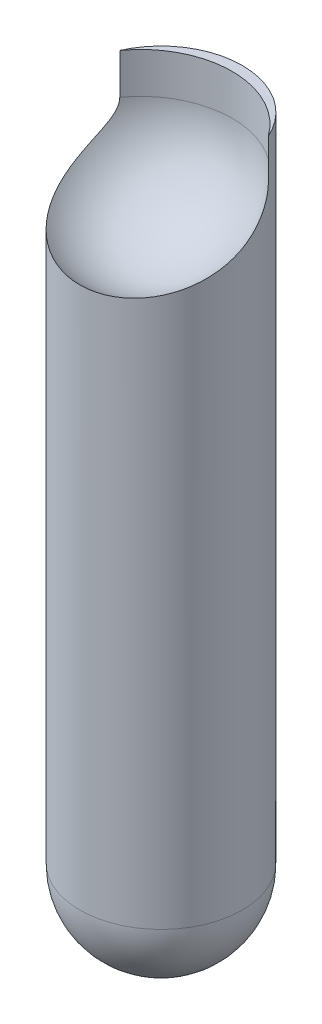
ISO-10303-21;
HEADER;
FILE_DESCRIPTION(('STEP AP214'),'2;1');
FILE_NAME('part.step','',(''),(''),'','','');
FILE_SCHEMA(('AUTOMOTIVE_DESIGN { 1 0 10303 214 1 1 1 1 }'));
ENDSEC;
DATA;
#1=APPLICATION_CONTEXT('core data for automotive mechanical design processes');
#2=APPLICATION_PROTOCOL_DEFINITION('international standard','automotive_design',2000,#1);
#3=PRODUCT_CONTEXT('',#1,'mechanical');
#4=PRODUCT('Part','Part','',(#3));
#5=PRODUCT_RELATED_PRODUCT_CATEGORY('part','',(#4));
#6=PRODUCT_DEFINITION_FORMATION('','',#4);
#7=PRODUCT_DEFINITION_CONTEXT('part definition',#1,'design');
#8=PRODUCT_DEFINITION('design','',#6,#7);
#9=PRODUCT_DEFINITION_SHAPE('','',#8);
#10=(LENGTH_UNIT() NAMED_UNIT(*) SI_UNIT(.MILLI.,.METRE.));
#11=(NAMED_UNIT(*) PLANE_ANGLE_UNIT() SI_UNIT($,.RADIAN.));
#12=(NAMED_UNIT(*) SI_UNIT($,.STERADIAN.) SOLID_ANGLE_UNIT());
#13=UNCERTAINTY_MEASURE_WITH_UNIT(LENGTH_MEASURE(1.E-05),#10,'distance_accuracy_value','');
#14=(GEOMETRIC_REPRESENTATION_CONTEXT(3) GLOBAL_UNCERTAINTY_ASSIGNED_CONTEXT((#13)) GLOBAL_UNIT_ASSIGNED_CONTEXT((#10,
#11,#12)) REPRESENTATION_CONTEXT('',''));
#15=CARTESIAN_POINT('',(0.,0.,0.));
#16=DIRECTION('',(0.,0.,1.));
#17=DIRECTION('',(1.,0.,0.));
#18=AXIS2_PLACEMENT_3D('',#15,#16,#17);
#19=CARTESIAN_POINT('',(0.,457.2,0.));
#20=DIRECTION('',(0.,-1.,0.));
#21=DIRECTION('',(0.,0.,-1.));
#22=AXIS2_PLACEMENT_3D('',#19,#20,#21);
#23=CYLINDRICAL_SURFACE('',#22,50.8);
#24=CARTESIAN_POINT('',(0.,50.8,0.));
#25=DIRECTION('',(0.,-1.,0.));
#26=DIRECTION('',(0.,0.,-1.));
#27=AXIS2_PLACEMENT_3D('',#24,#25,#26);
#28=CIRCLE('',#27,50.8);
#29=CARTESIAN_POINT('',(0.,50.8,-50.8));
#30=VERTEX_POINT('',#29);
#31=EDGE_CURVE('E75',#30,#30,#28,.F.);
#32=ORIENTED_EDGE('',*,*,#31,.T.);
#33=EDGE_LOOP('',(#32));
#34=FACE_BOUND('',#33,.T.);
#35=DIRECTION('',(0.,-1.,0.));
#36=VECTOR('',#35,1.);
#37=CARTESIAN_POINT('',(-46.4191080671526,444.5,-20.6375000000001));
#38=LINE('',#37,#36);
#39=CARTESIAN_POINT('',(-46.4191080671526,457.2,-20.6375000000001));
#40=VERTEX_POINT('',#39);
#41=CARTESIAN_POINT('',(-46.4191080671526,431.8,-20.6375000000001));
#42=VERTEX_POINT('',#41);
#43=EDGE_CURVE('E66',#40,#42,#38,.T.);
#44=ORIENTED_EDGE('',*,*,#43,.F.);
#45=CARTESIAN_POINT('',(0.,457.2,0.));
#46=DIRECTION('',(0.,1.,0.));
#47=DIRECTION('',(0.,0.,1.));
#48=AXIS2_PLACEMENT_3D('',#45,#46,#47);
#49=CIRCLE('',#48,50.8);
#50=CARTESIAN_POINT('',(46.4191080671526,457.2,-20.6375000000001));
#51=VERTEX_POINT('',#50);
#52=EDGE_CURVE('E70',#51,#40,#49,.T.);
#53=ORIENTED_EDGE('',*,*,#52,.F.);
#54=DIRECTION('',(0.,-1.,0.));
#55=VECTOR('',#54,1.);
#56=CARTESIAN_POINT('',(46.4191080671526,444.5,-20.6375000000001));
#57=LINE('',#56,#55);
#58=CARTESIAN_POINT('',(46.4191080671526,431.8,-20.6375000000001));
#59=VERTEX_POINT('',#58);
#60=EDGE_CURVE('E51',#59,#51,#57,.F.);
#61=ORIENTED_EDGE('',*,*,#60,.F.);
#62=CARTESIAN_POINT('',(-46.4191080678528,431.8002,-20.6374999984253));
#63=CARTESIAN_POINT('',(-46.4189922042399,431.438791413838,-20.6376794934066));
#64=CARTESIAN_POINT('',(-46.4259583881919,431.077498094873,-20.6220909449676));
#65=CARTESIAN_POINT('',(-46.4531862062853,430.358512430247,-20.5607270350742));
#66=CARTESIAN_POINT('',(-46.4734280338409,430.000815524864,-20.5149966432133));
#67=CARTESIAN_POINT('',(-46.5259645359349,429.296377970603,-20.3955520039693));
#68=CARTESIAN_POINT('',(-46.5580825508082,428.94955378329,-20.3222476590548));
#69=CARTESIAN_POINT('',(-46.6330016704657,428.263506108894,-20.1497404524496));
#70=CARTESIAN_POINT('',(-46.6758073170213,427.924285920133,-20.0505265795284));
#71=CARTESIAN_POINT('',(-46.7873865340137,427.135640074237,-19.7890668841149));
#72=CARTESIAN_POINT('',(-46.8599780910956,426.690018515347,-19.6169583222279));
#73=CARTESIAN_POINT('',(-47.0177180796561,425.817235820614,-19.235817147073));
#74=CARTESIAN_POINT('',(-47.1028712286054,425.390081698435,-19.0267706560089));
#75=CARTESIAN_POINT('',(-47.2824291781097,424.551780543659,-18.5760891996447));
#76=CARTESIAN_POINT('',(-47.376890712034,424.140756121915,-18.3342505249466));
#77=CARTESIAN_POINT('',(-47.5711798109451,423.336977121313,-17.8240666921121));
#78=CARTESIAN_POINT('',(-47.6710072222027,422.94422201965,-17.555722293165));
#79=CARTESIAN_POINT('',(-47.8659037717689,422.203493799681,-17.0167969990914));
#80=CARTESIAN_POINT('',(-47.9607968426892,421.854333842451,-16.747773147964));
#81=CARTESIAN_POINT('',(-48.1509215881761,421.169554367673,-16.1930462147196));
#82=CARTESIAN_POINT('',(-48.246153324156,420.83393745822,-15.9073399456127));
#83=CARTESIAN_POINT('',(-48.435446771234,420.175026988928,-15.3213040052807));
#84=CARTESIAN_POINT('',(-48.529507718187,419.851741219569,-15.0209653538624));
#85=CARTESIAN_POINT('',(-48.7151303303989,419.216667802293,-14.4075985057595));
#86=CARTESIAN_POINT('',(-48.8066916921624,418.90488154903,-14.0945687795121));
#87=CARTESIAN_POINT('',(-49.0761621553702,417.984680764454,-13.1380596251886));
#88=CARTESIAN_POINT('',(-49.2486616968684,417.392086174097,-12.4777588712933));
#89=CARTESIAN_POINT('',(-49.5724286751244,416.242959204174,-11.1220737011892));
#90=CARTESIAN_POINT('',(-49.7237005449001,415.686419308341,-10.4266966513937));
#91=CARTESIAN_POINT('',(-49.9803424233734,414.682236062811,-9.10979752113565));
#92=CARTESIAN_POINT('',(-50.0891860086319,414.230462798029,-8.4920861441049));
#93=CARTESIAN_POINT('',(-50.2855609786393,413.346963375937,-7.23909840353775));
#94=CARTESIAN_POINT('',(-50.3730899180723,412.915239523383,-6.60382003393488));
#95=CARTESIAN_POINT('',(-50.5249871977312,412.069685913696,-5.31834564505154));
#96=CARTESIAN_POINT('',(-50.5893448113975,411.655864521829,-4.66814286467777));
#97=CARTESIAN_POINT('',(-50.6933272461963,410.844692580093,-3.35559322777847));
#98=CARTESIAN_POINT('',(-50.7329516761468,410.447342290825,-2.69324617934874));
#99=CARTESIAN_POINT('',(-50.7862199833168,409.667784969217,-1.35864048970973));
#100=CARTESIAN_POINT('',(-50.7998628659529,409.285578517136,-0.686381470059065));
#101=CARTESIAN_POINT('',(-50.8001350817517,408.53524935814,0.665960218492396));
#102=CARTESIAN_POINT('',(-50.7867642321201,408.167126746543,1.34604294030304));
#103=CARTESIAN_POINT('',(-50.7321639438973,407.444171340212,2.71193956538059));
#104=CARTESIAN_POINT('',(-50.6909405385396,407.08933568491,3.3977521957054));
#105=CARTESIAN_POINT('',(-50.5799400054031,406.392127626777,4.77346276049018));
#106=CARTESIAN_POINT('',(-50.5101604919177,406.049756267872,5.46336103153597));
#107=CARTESIAN_POINT('',(-50.339888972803,405.370559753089,6.85847715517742));
#108=CARTESIAN_POINT('',(-50.2388410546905,405.033961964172,7.56373796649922));
#109=CARTESIAN_POINT('',(-50.0060392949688,404.372598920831,8.97482193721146));
#110=CARTESIAN_POINT('',(-49.874282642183,404.047834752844,9.68064514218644));
#111=CARTESIAN_POINT('',(-49.5797265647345,403.409773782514,11.0909713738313));
#112=CARTESIAN_POINT('',(-49.4169281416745,403.096476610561,11.7954744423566));
#113=CARTESIAN_POINT('',(-49.0600350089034,402.480982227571,13.2014799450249));
#114=CARTESIAN_POINT('',(-48.8659374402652,402.178786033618,13.902982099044));
#115=CARTESIAN_POINT('',(-48.4463752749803,401.585327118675,15.3010209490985));
#116=CARTESIAN_POINT('',(-48.2209176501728,401.294061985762,15.9975587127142));
#117=CARTESIAN_POINT('',(-47.7385551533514,400.722160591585,17.3841665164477));
#118=CARTESIAN_POINT('',(-47.4816473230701,400.441525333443,18.0742359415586));
#119=CARTESIAN_POINT('',(-46.9365054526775,399.890782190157,19.4460575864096));
#120=CARTESIAN_POINT('',(-46.6482748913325,399.62067314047,20.1278107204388));
#121=CARTESIAN_POINT('',(-46.0406111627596,399.090804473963,21.4814478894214));
#122=CARTESIAN_POINT('',(-45.7211750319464,398.831045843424,22.1533309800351));
#123=CARTESIAN_POINT('',(-45.0537642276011,398.323623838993,23.4807618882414));
#124=CARTESIAN_POINT('',(-44.7060088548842,398.075887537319,24.1363919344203));
#125=CARTESIAN_POINT('',(-43.9803813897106,397.590491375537,25.4346095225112));
#126=CARTESIAN_POINT('',(-43.6025063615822,397.352832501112,26.077195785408));
#127=CARTESIAN_POINT('',(-42.4243824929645,396.654960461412,27.9828650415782));
#128=CARTESIAN_POINT('',(-41.579448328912,396.209710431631,29.2242304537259));
#129=CARTESIAN_POINT('',(-39.7756932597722,395.359449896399,31.6354519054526));
#130=CARTESIAN_POINT('',(-38.8168872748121,394.95443413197,32.8053172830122));
#131=CARTESIAN_POINT('',(-36.7912894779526,394.184661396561,35.0619326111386));
#132=CARTESIAN_POINT('',(-35.7245034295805,393.819902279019,36.1486869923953));
#133=CARTESIAN_POINT('',(-33.5530791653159,393.150265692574,38.169438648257));
#134=CARTESIAN_POINT('',(-32.4539056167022,392.843178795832,39.1085821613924));
#135=CARTESIAN_POINT('',(-30.1734245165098,392.265484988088,40.8937773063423));
#136=CARTESIAN_POINT('',(-28.9921198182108,391.994876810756,41.7398321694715));
#137=CARTESIAN_POINT('',(-26.5560181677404,391.490556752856,43.3305173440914));
#138=CARTESIAN_POINT('',(-25.3012375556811,391.256836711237,44.0751700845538));
#139=CARTESIAN_POINT('',(-22.727242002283,390.826588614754,45.455970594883));
#140=CARTESIAN_POINT('',(-21.4080288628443,390.630059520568,46.0921213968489));
#141=CARTESIAN_POINT('',(-18.7736806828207,390.282244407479,47.2245128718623));
#142=CARTESIAN_POINT('',(-17.460845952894,390.129366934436,47.7256216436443));
#143=CARTESIAN_POINT('',(-14.7949441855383,389.858229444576,48.6181586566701));
#144=CARTESIAN_POINT('',(-13.4418784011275,389.739968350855,49.0095903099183));
#145=CARTESIAN_POINT('',(-10.7056282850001,389.53829333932,49.6791016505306));
#146=CARTESIAN_POINT('',(-9.32244790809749,389.454874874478,49.9571961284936));
#147=CARTESIAN_POINT('',(-6.53611526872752,389.323024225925,50.3975046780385));
#148=CARTESIAN_POINT('',(-5.13296322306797,389.274591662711,50.5597200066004));
#149=CARTESIAN_POINT('',(-2.35186663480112,389.21356675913,50.7642086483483));
#150=CARTESIAN_POINT('',(-0.974149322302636,389.200123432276,50.809329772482));
#151=CARTESIAN_POINT('',(1.78029895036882,389.206640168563,50.7874719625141));
#152=CARTESIAN_POINT('',(3.15702992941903,389.226599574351,50.7204952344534));
#153=CARTESIAN_POINT('',(5.89953033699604,389.299880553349,50.4750516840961));
#154=CARTESIAN_POINT('',(7.26530043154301,389.3532000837,50.2965916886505));
#155=CARTESIAN_POINT('',(9.97619877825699,389.493099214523,49.829781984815));
#156=CARTESIAN_POINT('',(11.3213269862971,389.579678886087,49.5414320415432));
#157=CARTESIAN_POINT('',(13.9745402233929,389.785406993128,48.859173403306));
#158=CARTESIAN_POINT('',(15.2827805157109,389.904385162,48.4658167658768));
#159=CARTESIAN_POINT('',(17.8603517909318,390.174894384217,47.5763238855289));
#160=CARTESIAN_POINT('',(19.1296830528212,390.32642520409,47.0801883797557));
#161=CARTESIAN_POINT('',(21.6208751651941,390.661795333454,45.9894200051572));
#162=CARTESIAN_POINT('',(22.8427352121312,390.84563518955,45.3947854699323));
#163=CARTESIAN_POINT('',(25.2309148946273,391.245345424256,44.1121090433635));
#164=CARTESIAN_POINT('',(26.3972338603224,391.461216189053,43.424066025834));
#165=CARTESIAN_POINT('',(28.6824391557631,391.927873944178,41.9503444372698));
#166=CARTESIAN_POINT('',(29.8004563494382,392.17909891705,41.163456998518));
#167=CARTESIAN_POINT('',(31.9647037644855,392.713858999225,39.5063948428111));
#168=CARTESIAN_POINT('',(33.010933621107,392.997394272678,38.6362197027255));
#169=CARTESIAN_POINT('',(35.0254236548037,393.596522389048,36.8198210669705));
#170=CARTESIAN_POINT('',(35.9936768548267,393.912118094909,35.8735907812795));
#171=CARTESIAN_POINT('',(37.846661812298,394.575117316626,33.9129722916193));
#172=CARTESIAN_POINT('',(38.7313919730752,394.922521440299,32.8985827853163));
#173=CARTESIAN_POINT('',(40.4390752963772,395.660375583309,30.7771494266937));
#174=CARTESIAN_POINT('',(41.2592236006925,396.051833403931,29.6681981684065));
#175=CARTESIAN_POINT('',(42.8016941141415,396.868388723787,27.3959947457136));
#176=CARTESIAN_POINT('',(43.5240145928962,397.293486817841,26.2327416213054));
#177=CARTESIAN_POINT('',(44.8676451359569,398.177382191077,23.8619136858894));
#178=CARTESIAN_POINT('',(45.4889706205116,398.636174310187,22.6543456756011));
#179=CARTESIAN_POINT('',(46.6287782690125,399.587995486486,20.2044963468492));
#180=CARTESIAN_POINT('',(47.1472586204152,400.081025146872,18.9622144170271));
#181=CARTESIAN_POINT('',(47.857746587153,400.858417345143,17.0518823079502));
#182=CARTESIAN_POINT('',(48.0875365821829,401.130173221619,16.3924908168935));
#183=CARTESIAN_POINT('',(48.518696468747,401.6833991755,15.0685284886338));
#184=CARTESIAN_POINT('',(48.7200685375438,401.964868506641,14.4039580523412));
#185=CARTESIAN_POINT('',(49.0944727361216,402.537755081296,13.0710399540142));
#186=CARTESIAN_POINT('',(49.2675011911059,402.82917360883,12.4026918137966));
#187=CARTESIAN_POINT('',(49.5853247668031,403.422151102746,11.0638545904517));
#188=CARTESIAN_POINT('',(49.7301222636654,403.723709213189,10.3933656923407));
#189=CARTESIAN_POINT('',(49.9919737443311,404.337854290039,9.05049116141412));
#190=CARTESIAN_POINT('',(50.1089763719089,404.650460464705,8.37810430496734));
#191=CARTESIAN_POINT('',(50.3152164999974,405.286526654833,7.03427662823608));
#192=CARTESIAN_POINT('',(50.4044562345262,405.60998579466,6.36283573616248));
#193=CARTESIAN_POINT('',(50.5556123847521,406.268238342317,5.02244179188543));
#194=CARTESIAN_POINT('',(50.6175288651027,406.603031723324,4.35348873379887));
#195=CARTESIAN_POINT('',(50.7145743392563,407.284482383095,3.019764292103));
#196=CARTESIAN_POINT('',(50.7497054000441,407.631138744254,2.35499258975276));
#197=CARTESIAN_POINT('',(50.7951446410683,408.357757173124,0.992385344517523));
#198=CARTESIAN_POINT('',(50.803873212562,408.738479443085,0.294901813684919));
#199=CARTESIAN_POINT('',(50.7930045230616,409.514998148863,-1.09141570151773));
#200=CARTESIAN_POINT('',(50.7734067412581,409.910794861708,-1.78024952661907));
#201=CARTESIAN_POINT('',(50.7070278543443,410.718899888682,-3.14736596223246));
#202=CARTESIAN_POINT('',(50.6602314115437,411.131217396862,-3.82564239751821));
#203=CARTESIAN_POINT('',(50.5408617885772,411.973648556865,-5.16873001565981));
#204=CARTESIAN_POINT('',(50.4682892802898,412.403761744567,-5.83354154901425));
#205=CARTESIAN_POINT('',(50.29942897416,413.281985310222,-7.14439990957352));
#206=CARTESIAN_POINT('',(50.2032327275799,413.730020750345,-7.7905086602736));
#207=CARTESIAN_POINT('',(49.9891051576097,414.647974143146,-9.06343536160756));
#208=CARTESIAN_POINT('',(49.8711715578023,415.117894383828,-9.69025128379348));
#209=CARTESIAN_POINT('',(49.61642952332,416.0818637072,-10.9198732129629));
#210=CARTESIAN_POINT('',(49.4796440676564,416.575882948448,-11.522707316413));
#211=CARTESIAN_POINT('',(49.190578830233,417.59201660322,-12.7001561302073));
#212=CARTESIAN_POINT('',(49.0383041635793,418.114121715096,-13.2747800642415));
#213=CARTESIAN_POINT('',(48.7732449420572,419.018965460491,-14.2114854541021));
#214=CARTESIAN_POINT('',(48.6633777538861,419.392967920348,-14.5828426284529));
#215=CARTESIAN_POINT('',(48.4404878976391,420.157730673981,-15.3069428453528));
#216=CARTESIAN_POINT('',(48.3274653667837,420.548490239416,-15.6596866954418));
#217=CARTESIAN_POINT('',(48.1004981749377,421.348859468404,-16.3435607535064));
#218=CARTESIAN_POINT('',(47.9865528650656,421.758483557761,-16.6746739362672));
#219=CARTESIAN_POINT('',(47.7607552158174,422.598140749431,-17.310808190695));
#220=CARTESIAN_POINT('',(47.6489026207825,423.028171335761,-17.6158324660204));
#221=CARTESIAN_POINT('',(47.4483345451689,423.840011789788,-18.1483657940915));
#222=CARTESIAN_POINT('',(47.3587731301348,424.218580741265,-18.3804804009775));
#223=CARTESIAN_POINT('',(47.186390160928,424.991966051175,-18.8186069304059));
#224=CARTESIAN_POINT('',(47.1035663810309,425.386776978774,-19.0246274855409));
#225=CARTESIAN_POINT('',(46.9480473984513,426.19102507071,-19.4052299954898));
#226=CARTESIAN_POINT('',(46.8753075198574,426.600386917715,-19.5799516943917));
#227=CARTESIAN_POINT('',(46.742876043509,427.434498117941,-19.8940360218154));
#228=CARTESIAN_POINT('',(46.6831781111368,427.859239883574,-20.033415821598));
#229=CARTESIAN_POINT('',(46.5978788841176,428.573462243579,-20.2307916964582));
#230=CARTESIAN_POINT('',(46.5676115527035,428.859237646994,-20.3002926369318));
#231=CARTESIAN_POINT('',(46.5149681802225,429.435364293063,-20.420627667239));
#232=CARTESIAN_POINT('',(46.4925898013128,429.725714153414,-20.4714672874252));
#233=CARTESIAN_POINT('',(46.4562589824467,430.312394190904,-20.5537872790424));
#234=CARTESIAN_POINT('',(46.4423851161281,430.608754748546,-20.5850871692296));
#235=CARTESIAN_POINT('',(46.4237777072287,431.203460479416,-20.6269960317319));
#236=CARTESIAN_POINT('',(46.4190517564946,431.501807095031,-20.6375878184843));
#237=CARTESIAN_POINT('',(46.4191080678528,431.8002,-20.6374999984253));
#238=B_SPLINE_CURVE_WITH_KNOTS('',3,(#62,#63,#64,#65,#66,#67,#68,#69,#70,#71,#72,#73,#74,#75,
#76,#77,#78,#79,#80,#81,#82,#83,#84,#85,#86,#87,#88,#89,#90,#91,#92,#93,#94,#95,#96,#97,#98,#99,
#100,#101,#102,#103,#104,#105,#106,#107,#108,#109,#110,#111,#112,#113,#114,#115,#116,#117,#118,
#119,#120,#121,#122,#123,#124,#125,#126,#127,#128,#129,#130,#131,#132,#133,#134,#135,#136,#137,
#138,#139,#140,#141,#142,#143,#144,#145,#146,#147,#148,#149,#150,#151,#152,#153,#154,#155,#156,
#157,#158,#159,#160,#161,#162,#163,#164,#165,#166,#167,#168,#169,#170,#171,#172,#173,#174,#175,
#176,#177,#178,#179,#180,#181,#182,#183,#184,#185,#186,#187,#188,#189,#190,#191,#192,#193,#194,
#195,#196,#197,#198,#199,#200,#201,#202,#203,#204,#205,#206,#207,#208,#209,#210,#211,#212,#213,
#214,#215,#216,#217,#218,#219,#220,#221,#222,#223,#224,#225,#226,#227,#228,#229,#230,#231,#232,
#233,#234,#235,#236,#237),.UNSPECIFIED.,.F.,.F.,(4,2,2,2,2,2,2,2,2,2,2,2,2,2,2,2,2,2,2,2,2,2,2,
2,2,2,2,2,2,2,2,2,2,2,2,2,2,2,2,2,2,2,2,2,2,2,2,2,2,2,2,2,2,2,2,2,2,2,2,2,2,2,2,2,2,2,2,2,2,2,2,
2,2,2,2,2,2,2,2,2,2,2,2,2,2,2,2,4),(0.,1.08363774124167,2.1656624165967,3.23220003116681,
4.29919165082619,5.74640437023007,7.19416197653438,8.65136474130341,10.108525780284,
11.460596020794,12.8129254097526,14.1660954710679,15.519429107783,18.2288312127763,
20.9376666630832,23.2558630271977,25.5743252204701,27.8938593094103,30.2134300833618,
32.533089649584,34.8527649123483,37.1719378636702,39.4913046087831,41.8545381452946,
44.217988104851,46.5813618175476,48.9449515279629,51.3080166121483,53.6713041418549,
56.03432946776,58.3975794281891,60.7440092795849,63.0906681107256,67.7826718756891,
72.4740615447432,77.1652009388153,81.5936512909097,86.0219478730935,90.4492633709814,
94.8764551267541,99.1118083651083,103.34702982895,107.581698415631,111.816321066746,
115.946945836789,120.07748931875,124.207779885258,128.338079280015,132.447077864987,
136.556046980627,140.665085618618,144.774173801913,148.939577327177,153.105002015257,
157.27079899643,161.436675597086,165.73310327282,170.02960693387,174.325453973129,
178.621376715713,180.868762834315,183.115976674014,185.363481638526,187.610797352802,
189.862233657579,192.113488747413,194.3647385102,196.61581453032,198.999141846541,
201.382512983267,203.76722944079,206.151883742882,208.527438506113,210.903242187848,
213.27617514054,215.64832699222,217.26297773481,218.877558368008,220.493394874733,
222.109032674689,223.467120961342,224.82475877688,226.176175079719,227.526933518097,
228.413265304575,229.299334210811,230.19347080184,231.088349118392),.UNSPECIFIED.);
#239=EDGE_CURVE('E11',#42,#59,#238,.T.);
#240=ORIENTED_EDGE('',*,*,#239,.F.);
#241=EDGE_LOOP('',(#44,#53,#61,#240));
#242=FACE_BOUND('',#241,.T.);
#243=ADVANCED_FACE('F32',(#34,#242),#23,.T.);
#244=CARTESIAN_POINT('',(0.,457.2,0.));
#245=DIRECTION('',(0.,1.,0.));
#246=DIRECTION('',(0.,0.,1.));
#247=AXIS2_PLACEMENT_3D('',#244,#245,#246);
#248=PLANE('',#247);
#249=ORIENTED_EDGE('',*,*,#52,.T.);
#250=CARTESIAN_POINT('',(0.,457.2,12.6999999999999));
#251=DIRECTION('',(0.,1.,0.));
#252=DIRECTION('',(0.,0.,1.));
#253=AXIS2_PLACEMENT_3D('',#250,#251,#252);
#254=CIRCLE('',#253,57.15);
#255=EDGE_CURVE('E44',#40,#51,#254,.F.);
#256=ORIENTED_EDGE('',*,*,#255,.T.);
#257=EDGE_LOOP('',(#249,#256));
#258=FACE_BOUND('',#257,.T.);
#259=ADVANCED_FACE('F78',(#258),#248,.T.);
#260=CARTESIAN_POINT('',(0.,50.8,0.));
#261=DIRECTION('',(0.,0.,1.));
#262=DIRECTION('',(1.,0.,0.));
#263=AXIS2_PLACEMENT_3D('',#260,#261,#262);
#264=SPHERICAL_SURFACE('',#263,50.8);
#265=CARTESIAN_POINT('',(0.,50.8,0.));
#266=DIRECTION('',(0.,-1.,0.));
#267=DIRECTION('',(0.,0.,-1.));
#268=AXIS2_PLACEMENT_3D('',#265,#266,#267);
#269=SPHERICAL_SURFACE('',#268,50.8);
#270=ORIENTED_EDGE('',*,*,#31,.F.);
#271=EDGE_LOOP('',(#270));
#272=FACE_BOUND('',#271,.T.);
#273=ADVANCED_FACE('F34',(#272),#269,.T.);
#274=CARTESIAN_POINT('',(0.,431.8,12.6999999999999));
#275=DIRECTION('',(0.,-1.,0.));
#276=DIRECTION('',(0.,0.,-1.));
#277=AXIS2_PLACEMENT_3D('',#274,#275,#276);
#278=SPHERICAL_SURFACE('',#277,57.15);
#279=ORIENTED_EDGE('',*,*,#239,.T.);
#280=CARTESIAN_POINT('',(0.,431.8,12.6999999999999));
#281=DIRECTION('',(0.,-1.,0.));
#282=DIRECTION('',(0.,0.,-1.));
#283=AXIS2_PLACEMENT_3D('',#280,#281,#282);
#284=CIRCLE('',#283,57.15);
#285=EDGE_CURVE('E63',#42,#59,#284,.T.);
#286=ORIENTED_EDGE('',*,*,#285,.F.);
#287=EDGE_LOOP('',(#279,#286));
#288=FACE_BOUND('',#287,.T.);
#289=ADVANCED_FACE('F62',(#288),#278,.F.);
#290=CARTESIAN_POINT('',(0.,374.65,12.6999999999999));
#291=DIRECTION('',(0.,-1.,0.));
#292=DIRECTION('',(0.,0.,-1.));
#293=AXIS2_PLACEMENT_3D('',#290,#291,#292);
#294=CYLINDRICAL_SURFACE('',#293,57.15);
#295=ORIENTED_EDGE('',*,*,#43,.T.);
#296=ORIENTED_EDGE('',*,*,#285,.T.);
#297=ORIENTED_EDGE('',*,*,#60,.T.);
#298=ORIENTED_EDGE('',*,*,#255,.F.);
#299=EDGE_LOOP('',(#295,#296,#297,#298));
#300=FACE_BOUND('',#299,.T.);
#301=ADVANCED_FACE('F65',(#300),#294,.F.);
#302=CLOSED_SHELL('',(#243,#259,#273,#289,#301));
#303=MANIFOLD_SOLID_BREP('B2',#302);
#304=ADVANCED_BREP_SHAPE_REPRESENTATION('',(#18,#303),#14);
#305=SHAPE_DEFINITION_REPRESENTATION(#9,#304);
ENDSEC;
END-ISO-10303-21;
